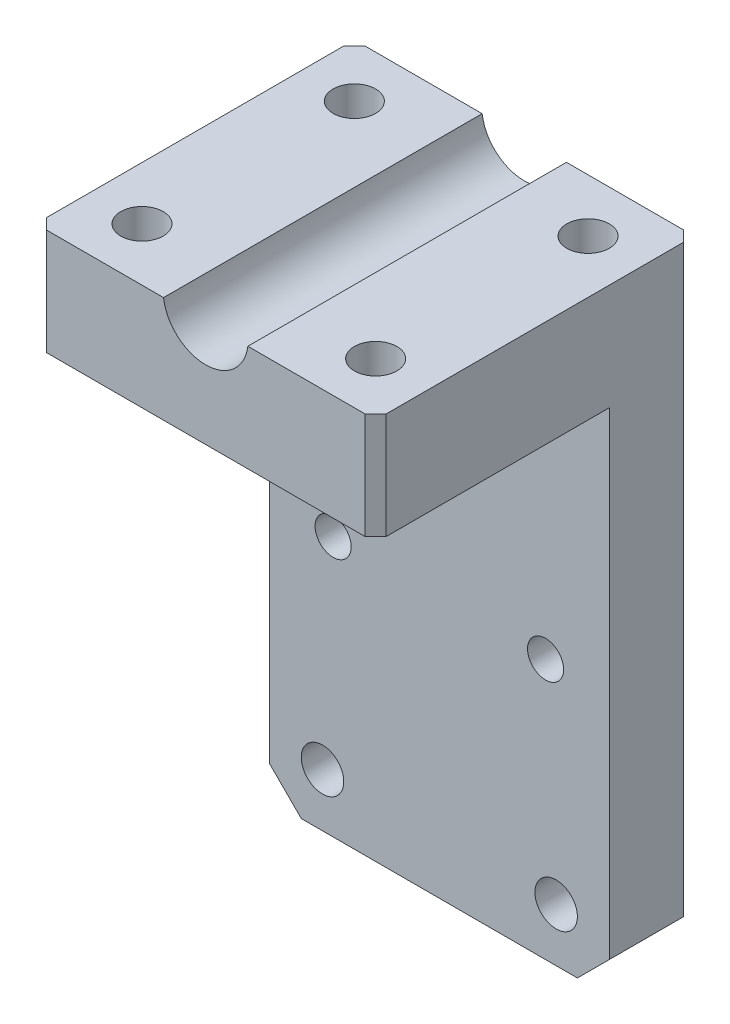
from build123d import *

# Parameters (mm, degrees)
SKIZZE1_W                                            = 32
SKIZZE1_H                                            = 58
AUFSATZ_LINEAR_AUSTRAGEN1_DEPTH                      = 30
SKIZZE2_W                                            = 22
SKIZZE2_H                                            = 48
SCHNITT_LINEAR_AUSTRAGEN1_DEPTH                      = 53.583267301
STIRNSENKUNG_F_R_M3_FLACHKOPFSCHRAUBE_MI_D           = 3.4
STIRNSENKUNG_F_R_M3_FLACHKOPFSCHRAUBE_MI_CBORE_D     = 7
STIRNSENKUNG_F_R_M3_FLACHKOPFSCHRAUBE_MI_CBORE_DEPTH = 2.4
F_4_0_4_DURCHMESSER_BOHRUNG1_D                       = 4
FASE2_SIZE                                           = 3
SKIZZE20_R                                           = 4
SCHNITT_LINEAR_AUSTRAGEN3_DEPTH                      = 45.687805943
F_4_0_4_DURCHMESSER_BOHRUNG2_D                       = 4
F_4_0_4_DURCHMESSER_BOHRUNG2_DEPTH                   = 7
FASE3_SIZE                                           = 1


with BuildPart() as part:
    # Skizze1 → Aufsatz-Linear austragen1 (new body)
    with BuildSketch(Plane.XY):
        Rectangle(SKIZZE1_W, SKIZZE1_H)
    extrude(amount=-AUFSATZ_LINEAR_AUSTRAGEN1_DEPTH)

    # Skizze2 → Schnitt-Linear austragen1 (cut, through all)
    with BuildSketch(Plane(origin=(16, 0, 0), x_dir=(0, 0, -1), z_dir=(1, 0, 0))):
        with Locations((11, -5)):
            Rectangle(SKIZZE2_W, SKIZZE2_H)
    extrude(amount=-SCHNITT_LINEAR_AUSTRAGEN1_DEPTH, mode=Mode.SUBTRACT)

    # Stirnsenkung f_r M3 Flachkopfschraube mi (through all)
    with Locations(Plane(origin=(0, 0, -30), x_dir=(1, 0, 0), z_dir=(0, 0, -1))):
        with Locations((-10, 4.5), (10, 4.5), (-10, -15.5), (10, -15.5)):
            CounterBoreHole(STIRNSENKUNG_F_R_M3_FLACHKOPFSCHRAUBE_MI_D / 2, STIRNSENKUNG_F_R_M3_FLACHKOPFSCHRAUBE_MI_CBORE_D / 2, STIRNSENKUNG_F_R_M3_FLACHKOPFSCHRAUBE_MI_CBORE_DEPTH)

    # 4.0 _4_ Durchmesser Bohrung1 (through all)
    with Locations(Plane(origin=(0, 0, -30), x_dir=(1, 0, 0), z_dir=(0, 0, -1))):
        with Locations((-11, 24), (11, 24)):
            Hole(F_4_0_4_DURCHMESSER_BOHRUNG1_D / 2)

    # Fase2
    fase2_edges = [part.edges().sort_by_distance(p)[0] for p in [
        (16, -29, -26),
        (-16, -29, -26),
    ]]
    chamfer(fase2_edges, length=FASE2_SIZE)

    # Skizze20 → Schnitt-Linear austragen3 (cut, through all)
    with BuildSketch(Plane(origin=(0, 0, -30), x_dir=(-1, 0, 0), z_dir=(0, 0, -1))):
        with Locations((0, 29.5)):
            Circle(SKIZZE20_R)
    extrude(amount=-SCHNITT_LINEAR_AUSTRAGEN3_DEPTH, mode=Mode.SUBTRACT)

    # 4.0 _4_ Durchmesser Bohrung2
    with Locations(Plane(origin=(0, 29, 0), x_dir=(1, 0, 0), z_dir=(0, 1, 0))):
        with Locations((-11, 25), (11, 25), (11, 5), (-11, 5)):
            Hole(F_4_0_4_DURCHMESSER_BOHRUNG2_D / 2, depth=F_4_0_4_DURCHMESSER_BOHRUNG2_DEPTH)

    # Fase3
    fase3_edges = [part.edges().sort_by_distance(p)[0] for p in [
        (-16, 1.5, -30),
        (16, 24, 0),
        (-16, 24, 0),
        (0, -29, -30),
        (16, 1.5, -30),
        (14.5, -27.5, -30),
        (-14.5, -27.5, -30),
    ]]
    chamfer(fase3_edges, length=FASE3_SIZE)


solid = part.part
